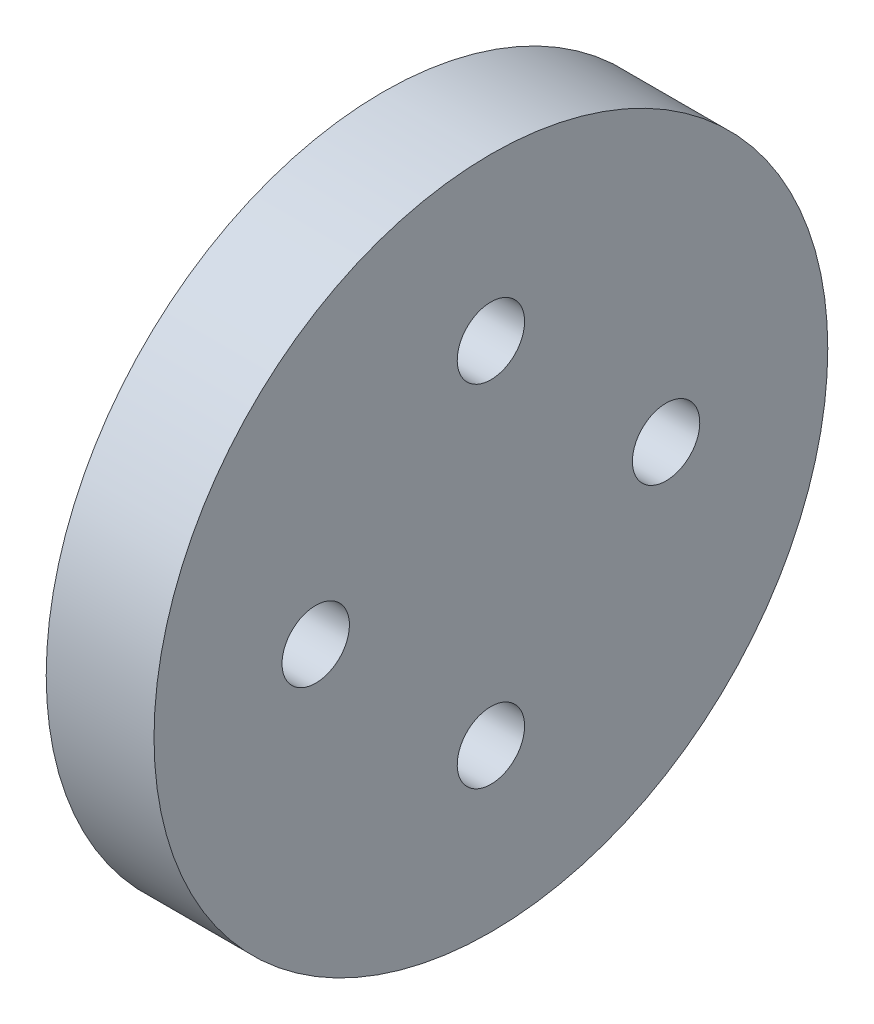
from build123d import *

# Parameters (mm, degrees)
ESQUISSE2_R             = 1.25
ENL_V_MAT_EXTRU_1_DEPTH = 20.836834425


with BuildPart() as part:
    # Esquisse1 → Base-R_volution (revolve)
    with BuildSketch(Plane.XY):
        Polygon((0, 0), (0, 12.5), (-4, 12.5), (-4, 4), (-8, 4), (-9, 3), (-9, 0), align=None)
    revolve(axis=Axis((0, 0, 0), (-1, 0, 0)))

    # Esquisse2 → Enl_v. mat.-Extru.1 (cut, through all)
    with BuildSketch(Plane(origin=(0, 0, 0), x_dir=(0, 0, -1), z_dir=(1, 0, 0))):
        with Locations(Location((-6.5, 0, 0), (0, 0, 90))):
            Circle(ESQUISSE2_R)
        with Locations(Location((6.5, 0, 0), (0, 0, 90))):
            Circle(ESQUISSE2_R)
        with Locations(Location((0, -6.5, 0), (0, 0, 90))):
            Circle(ESQUISSE2_R)
        with Locations(Location((0, 6.5, 0), (0, 0, 90))):
            Circle(ESQUISSE2_R)
    extrude(amount=-ENL_V_MAT_EXTRU_1_DEPTH, mode=Mode.SUBTRACT)


solid = part.part
